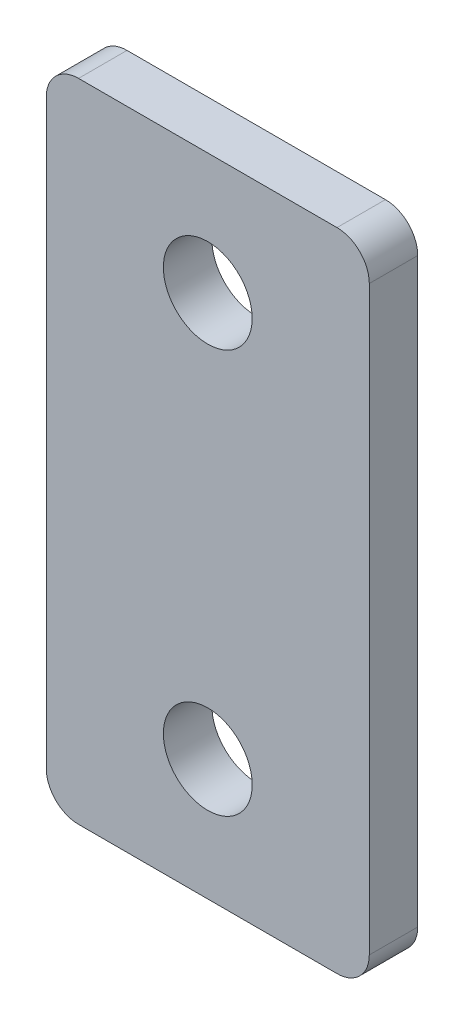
ISO-10303-21;
HEADER;
FILE_DESCRIPTION(('STEP AP214'),'2;1');
FILE_NAME('part.step','',(''),(''),'','','');
FILE_SCHEMA(('AUTOMOTIVE_DESIGN { 1 0 10303 214 1 1 1 1 }'));
ENDSEC;
DATA;
#1=APPLICATION_CONTEXT('core data for automotive mechanical design processes');
#2=APPLICATION_PROTOCOL_DEFINITION('international standard','automotive_design',2000,#1);
#3=PRODUCT_CONTEXT('',#1,'mechanical');
#4=PRODUCT('Part','Part','',(#3));
#5=PRODUCT_RELATED_PRODUCT_CATEGORY('part','',(#4));
#6=PRODUCT_DEFINITION_FORMATION('','',#4);
#7=PRODUCT_DEFINITION_CONTEXT('part definition',#1,'design');
#8=PRODUCT_DEFINITION('design','',#6,#7);
#9=PRODUCT_DEFINITION_SHAPE('','',#8);
#10=(LENGTH_UNIT() NAMED_UNIT(*) SI_UNIT(.MILLI.,.METRE.));
#11=(NAMED_UNIT(*) PLANE_ANGLE_UNIT() SI_UNIT($,.RADIAN.));
#12=(NAMED_UNIT(*) SI_UNIT($,.STERADIAN.) SOLID_ANGLE_UNIT());
#13=UNCERTAINTY_MEASURE_WITH_UNIT(LENGTH_MEASURE(1.E-05),#10,'distance_accuracy_value','');
#14=(GEOMETRIC_REPRESENTATION_CONTEXT(3) GLOBAL_UNCERTAINTY_ASSIGNED_CONTEXT((#13)) GLOBAL_UNIT_ASSIGNED_CONTEXT((#10,
#11,#12)) REPRESENTATION_CONTEXT('',''));
#15=CARTESIAN_POINT('',(0.,0.,0.));
#16=DIRECTION('',(0.,0.,1.));
#17=DIRECTION('',(1.,0.,0.));
#18=AXIS2_PLACEMENT_3D('',#15,#16,#17);
#19=CARTESIAN_POINT('',(2.,38.,0.));
#20=DIRECTION('',(0.,0.,-1.));
#21=DIRECTION('',(-1.,0.,0.));
#22=AXIS2_PLACEMENT_3D('',#19,#20,#21);
#23=PLANE('',#22);
#24=CARTESIAN_POINT('',(10.,32.5,0.));
#25=DIRECTION('',(0.,0.,1.));
#26=DIRECTION('',(1.,0.,0.));
#27=AXIS2_PLACEMENT_3D('',#24,#25,#26);
#28=CIRCLE('',#27,2.75);
#29=CARTESIAN_POINT('',(12.75,32.5,0.));
#30=VERTEX_POINT('',#29);
#31=EDGE_CURVE('E119',#30,#30,#28,.T.);
#32=ORIENTED_EDGE('',*,*,#31,.T.);
#33=EDGE_LOOP('',(#32));
#34=FACE_BOUND('',#33,.T.);
#35=CARTESIAN_POINT('',(2.,38.,0.));
#36=DIRECTION('',(0.,0.,-1.));
#37=DIRECTION('',(-1.,0.,0.));
#38=AXIS2_PLACEMENT_3D('',#35,#36,#37);
#39=CIRCLE('',#38,2.);
#40=CARTESIAN_POINT('',(0.,38.,0.));
#41=VERTEX_POINT('',#40);
#42=CARTESIAN_POINT('',(2.,40.,0.));
#43=VERTEX_POINT('',#42);
#44=EDGE_CURVE('E96',#41,#43,#39,.T.);
#45=ORIENTED_EDGE('',*,*,#44,.T.);
#46=DIRECTION('',(1.,0.,0.));
#47=VECTOR('',#46,1.);
#48=CARTESIAN_POINT('',(2.,40.,0.));
#49=LINE('',#48,#47);
#50=CARTESIAN_POINT('',(18.,40.,0.));
#51=VERTEX_POINT('',#50);
#52=EDGE_CURVE('E103',#43,#51,#49,.T.);
#53=ORIENTED_EDGE('',*,*,#52,.T.);
#54=CARTESIAN_POINT('',(18.,38.,0.));
#55=DIRECTION('',(0.,0.,1.));
#56=DIRECTION('',(1.,0.,0.));
#57=AXIS2_PLACEMENT_3D('',#54,#55,#56);
#58=CIRCLE('',#57,2.);
#59=CARTESIAN_POINT('',(20.,38.,0.));
#60=VERTEX_POINT('',#59);
#61=EDGE_CURVE('E109',#60,#51,#58,.T.);
#62=ORIENTED_EDGE('',*,*,#61,.F.);
#63=DIRECTION('',(0.,1.,0.));
#64=VECTOR('',#63,1.);
#65=CARTESIAN_POINT('',(20.,2.00000000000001,0.));
#66=LINE('',#65,#64);
#67=CARTESIAN_POINT('',(20.,2.00000000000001,0.));
#68=VERTEX_POINT('',#67);
#69=EDGE_CURVE('E124',#68,#60,#66,.T.);
#70=ORIENTED_EDGE('',*,*,#69,.F.);
#71=CARTESIAN_POINT('',(18.,2.,0.));
#72=DIRECTION('',(0.,0.,-1.));
#73=DIRECTION('',(-1.,0.,0.));
#74=AXIS2_PLACEMENT_3D('',#71,#72,#73);
#75=CIRCLE('',#74,2.);
#76=CARTESIAN_POINT('',(18.,0.,0.));
#77=VERTEX_POINT('',#76);
#78=EDGE_CURVE('E126',#68,#77,#75,.T.);
#79=ORIENTED_EDGE('',*,*,#78,.T.);
#80=DIRECTION('',(-1.,0.,0.));
#81=VECTOR('',#80,1.);
#82=CARTESIAN_POINT('',(18.,0.,0.));
#83=LINE('',#82,#81);
#84=CARTESIAN_POINT('',(2.00000000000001,0.,0.));
#85=VERTEX_POINT('',#84);
#86=EDGE_CURVE('E129',#77,#85,#83,.T.);
#87=ORIENTED_EDGE('',*,*,#86,.T.);
#88=CARTESIAN_POINT('',(2.,2.,0.));
#89=DIRECTION('',(0.,0.,-1.));
#90=DIRECTION('',(-1.,0.,0.));
#91=AXIS2_PLACEMENT_3D('',#88,#89,#90);
#92=CIRCLE('',#91,2.);
#93=CARTESIAN_POINT('',(0.,2.00000000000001,0.));
#94=VERTEX_POINT('',#93);
#95=EDGE_CURVE('E132',#85,#94,#92,.T.);
#96=ORIENTED_EDGE('',*,*,#95,.T.);
#97=DIRECTION('',(0.,-1.,0.));
#98=VECTOR('',#97,1.);
#99=CARTESIAN_POINT('',(0.,38.,0.));
#100=LINE('',#99,#98);
#101=EDGE_CURVE('E115',#41,#94,#100,.T.);
#102=ORIENTED_EDGE('',*,*,#101,.F.);
#103=EDGE_LOOP('',(#45,#53,#62,#70,#79,#87,#96,#102));
#104=FACE_BOUND('',#103,.T.);
#105=CARTESIAN_POINT('',(10.,7.5,0.));
#106=DIRECTION('',(0.,0.,1.));
#107=DIRECTION('',(1.,0.,0.));
#108=AXIS2_PLACEMENT_3D('',#105,#106,#107);
#109=CIRCLE('',#108,2.75);
#110=CARTESIAN_POINT('',(12.75,7.5,0.));
#111=VERTEX_POINT('',#110);
#112=EDGE_CURVE('E262',#111,#111,#109,.T.);
#113=ORIENTED_EDGE('',*,*,#112,.T.);
#114=EDGE_LOOP('',(#113));
#115=FACE_BOUND('',#114,.T.);
#116=ADVANCED_FACE('F30',(#34,#104,#115),#23,.T.);
#117=CARTESIAN_POINT('',(2.,38.,3.));
#118=DIRECTION('',(0.,0.,-1.));
#119=DIRECTION('',(-1.,0.,0.));
#120=AXIS2_PLACEMENT_3D('',#117,#118,#119);
#121=PLANE('',#120);
#122=CARTESIAN_POINT('',(10.,32.5,3.));
#123=DIRECTION('',(0.,0.,1.));
#124=DIRECTION('',(1.,0.,0.));
#125=AXIS2_PLACEMENT_3D('',#122,#123,#124);
#126=CIRCLE('',#125,2.75);
#127=CARTESIAN_POINT('',(12.75,32.5,3.));
#128=VERTEX_POINT('',#127);
#129=EDGE_CURVE('E116',#128,#128,#126,.T.);
#130=ORIENTED_EDGE('',*,*,#129,.F.);
#131=EDGE_LOOP('',(#130));
#132=FACE_BOUND('',#131,.T.);
#133=CARTESIAN_POINT('',(2.,38.,3.));
#134=DIRECTION('',(0.,0.,-1.));
#135=DIRECTION('',(-1.,0.,0.));
#136=AXIS2_PLACEMENT_3D('',#133,#134,#135);
#137=CIRCLE('',#136,2.);
#138=CARTESIAN_POINT('',(0.,38.,3.));
#139=VERTEX_POINT('',#138);
#140=CARTESIAN_POINT('',(2.,40.,3.));
#141=VERTEX_POINT('',#140);
#142=EDGE_CURVE('E97',#139,#141,#137,.T.);
#143=ORIENTED_EDGE('',*,*,#142,.F.);
#144=DIRECTION('',(0.,-1.,0.));
#145=VECTOR('',#144,1.);
#146=CARTESIAN_POINT('',(0.,38.,3.));
#147=LINE('',#146,#145);
#148=CARTESIAN_POINT('',(0.,2.00000000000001,3.));
#149=VERTEX_POINT('',#148);
#150=EDGE_CURVE('E52',#139,#149,#147,.T.);
#151=ORIENTED_EDGE('',*,*,#150,.T.);
#152=CARTESIAN_POINT('',(2.,2.,3.));
#153=DIRECTION('',(0.,0.,-1.));
#154=DIRECTION('',(-1.,0.,0.));
#155=AXIS2_PLACEMENT_3D('',#152,#153,#154);
#156=CIRCLE('',#155,2.);
#157=CARTESIAN_POINT('',(2.00000000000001,0.,3.));
#158=VERTEX_POINT('',#157);
#159=EDGE_CURVE('E148',#158,#149,#156,.T.);
#160=ORIENTED_EDGE('',*,*,#159,.F.);
#161=DIRECTION('',(-1.,0.,0.));
#162=VECTOR('',#161,1.);
#163=CARTESIAN_POINT('',(18.,0.,3.));
#164=LINE('',#163,#162);
#165=CARTESIAN_POINT('',(18.,0.,3.));
#166=VERTEX_POINT('',#165);
#167=EDGE_CURVE('E145',#166,#158,#164,.T.);
#168=ORIENTED_EDGE('',*,*,#167,.F.);
#169=CARTESIAN_POINT('',(18.,2.,3.));
#170=DIRECTION('',(0.,0.,-1.));
#171=DIRECTION('',(-1.,0.,0.));
#172=AXIS2_PLACEMENT_3D('',#169,#170,#171);
#173=CIRCLE('',#172,2.);
#174=CARTESIAN_POINT('',(20.,2.00000000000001,3.));
#175=VERTEX_POINT('',#174);
#176=EDGE_CURVE('E142',#175,#166,#173,.T.);
#177=ORIENTED_EDGE('',*,*,#176,.F.);
#178=DIRECTION('',(0.,1.,0.));
#179=VECTOR('',#178,1.);
#180=CARTESIAN_POINT('',(20.,2.00000000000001,3.));
#181=LINE('',#180,#179);
#182=CARTESIAN_POINT('',(20.,38.,3.));
#183=VERTEX_POINT('',#182);
#184=EDGE_CURVE('E140',#175,#183,#181,.T.);
#185=ORIENTED_EDGE('',*,*,#184,.T.);
#186=CARTESIAN_POINT('',(18.,38.,3.));
#187=DIRECTION('',(0.,0.,1.));
#188=DIRECTION('',(1.,0.,0.));
#189=AXIS2_PLACEMENT_3D('',#186,#187,#188);
#190=CIRCLE('',#189,2.);
#191=CARTESIAN_POINT('',(18.,40.,3.));
#192=VERTEX_POINT('',#191);
#193=EDGE_CURVE('E138',#183,#192,#190,.T.);
#194=ORIENTED_EDGE('',*,*,#193,.T.);
#195=DIRECTION('',(1.,0.,0.));
#196=VECTOR('',#195,1.);
#197=CARTESIAN_POINT('',(2.,40.,3.));
#198=LINE('',#197,#196);
#199=EDGE_CURVE('E136',#141,#192,#198,.T.);
#200=ORIENTED_EDGE('',*,*,#199,.F.);
#201=EDGE_LOOP('',(#143,#151,#160,#168,#177,#185,#194,#200));
#202=FACE_BOUND('',#201,.T.);
#203=CARTESIAN_POINT('',(10.,7.5,3.));
#204=DIRECTION('',(0.,0.,1.));
#205=DIRECTION('',(1.,0.,0.));
#206=AXIS2_PLACEMENT_3D('',#203,#204,#205);
#207=CIRCLE('',#206,2.75);
#208=CARTESIAN_POINT('',(12.75,7.5,3.));
#209=VERTEX_POINT('',#208);
#210=EDGE_CURVE('E259',#209,#209,#207,.T.);
#211=ORIENTED_EDGE('',*,*,#210,.F.);
#212=EDGE_LOOP('',(#211));
#213=FACE_BOUND('',#212,.T.);
#214=ADVANCED_FACE('F181',(#132,#202,#213),#121,.F.);
#215=CARTESIAN_POINT('',(2.,38.,3.));
#216=DIRECTION('',(0.,0.,-1.));
#217=DIRECTION('',(-1.,0.,0.));
#218=AXIS2_PLACEMENT_3D('',#215,#216,#217);
#219=CYLINDRICAL_SURFACE('',#218,2.);
#220=ORIENTED_EDGE('',*,*,#44,.F.);
#221=DIRECTION('',(0.,0.,-1.));
#222=VECTOR('',#221,1.);
#223=CARTESIAN_POINT('',(0.,38.,3.));
#224=LINE('',#223,#222);
#225=EDGE_CURVE('E11',#139,#41,#224,.T.);
#226=ORIENTED_EDGE('',*,*,#225,.F.);
#227=ORIENTED_EDGE('',*,*,#142,.T.);
#228=DIRECTION('',(0.,0.,-1.));
#229=VECTOR('',#228,1.);
#230=CARTESIAN_POINT('',(2.,40.,3.));
#231=LINE('',#230,#229);
#232=EDGE_CURVE('E34',#141,#43,#231,.T.);
#233=ORIENTED_EDGE('',*,*,#232,.T.);
#234=EDGE_LOOP('',(#220,#226,#227,#233));
#235=FACE_BOUND('',#234,.T.);
#236=ADVANCED_FACE('F32',(#235),#219,.T.);
#237=CARTESIAN_POINT('',(0.,38.,3.));
#238=DIRECTION('',(1.,0.,0.));
#239=DIRECTION('',(0.,1.,0.));
#240=AXIS2_PLACEMENT_3D('',#237,#238,#239);
#241=PLANE('',#240);
#242=ORIENTED_EDGE('',*,*,#101,.T.);
#243=DIRECTION('',(0.,0.,-1.));
#244=VECTOR('',#243,1.);
#245=CARTESIAN_POINT('',(0.,2.00000000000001,3.));
#246=LINE('',#245,#244);
#247=EDGE_CURVE('E39',#149,#94,#246,.T.);
#248=ORIENTED_EDGE('',*,*,#247,.F.);
#249=ORIENTED_EDGE('',*,*,#150,.F.);
#250=ORIENTED_EDGE('',*,*,#225,.T.);
#251=EDGE_LOOP('',(#242,#248,#249,#250));
#252=FACE_BOUND('',#251,.T.);
#253=ADVANCED_FACE('F180',(#252),#241,.F.);
#254=CARTESIAN_POINT('',(2.,2.,3.));
#255=DIRECTION('',(0.,0.,-1.));
#256=DIRECTION('',(-1.,0.,0.));
#257=AXIS2_PLACEMENT_3D('',#254,#255,#256);
#258=CYLINDRICAL_SURFACE('',#257,2.);
#259=ORIENTED_EDGE('',*,*,#95,.F.);
#260=DIRECTION('',(0.,0.,-1.));
#261=VECTOR('',#260,1.);
#262=CARTESIAN_POINT('',(2.00000000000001,0.,3.));
#263=LINE('',#262,#261);
#264=EDGE_CURVE('E153',#158,#85,#263,.T.);
#265=ORIENTED_EDGE('',*,*,#264,.F.);
#266=ORIENTED_EDGE('',*,*,#159,.T.);
#267=ORIENTED_EDGE('',*,*,#247,.T.);
#268=EDGE_LOOP('',(#259,#265,#266,#267));
#269=FACE_BOUND('',#268,.T.);
#270=ADVANCED_FACE('F178',(#269),#258,.T.);
#271=CARTESIAN_POINT('',(18.,0.,3.));
#272=DIRECTION('',(0.,-1.,0.));
#273=DIRECTION('',(1.,0.,0.));
#274=AXIS2_PLACEMENT_3D('',#271,#272,#273);
#275=PLANE('',#274);
#276=ORIENTED_EDGE('',*,*,#86,.F.);
#277=DIRECTION('',(0.,0.,-1.));
#278=VECTOR('',#277,1.);
#279=CARTESIAN_POINT('',(18.,0.,3.));
#280=LINE('',#279,#278);
#281=EDGE_CURVE('E155',#166,#77,#280,.T.);
#282=ORIENTED_EDGE('',*,*,#281,.F.);
#283=ORIENTED_EDGE('',*,*,#167,.T.);
#284=ORIENTED_EDGE('',*,*,#264,.T.);
#285=EDGE_LOOP('',(#276,#282,#283,#284));
#286=FACE_BOUND('',#285,.T.);
#287=ADVANCED_FACE('F175',(#286),#275,.T.);
#288=CARTESIAN_POINT('',(18.,2.,3.));
#289=DIRECTION('',(0.,0.,-1.));
#290=DIRECTION('',(-1.,0.,0.));
#291=AXIS2_PLACEMENT_3D('',#288,#289,#290);
#292=CYLINDRICAL_SURFACE('',#291,2.);
#293=ORIENTED_EDGE('',*,*,#78,.F.);
#294=DIRECTION('',(0.,0.,-1.));
#295=VECTOR('',#294,1.);
#296=CARTESIAN_POINT('',(20.,2.00000000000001,3.));
#297=LINE('',#296,#295);
#298=EDGE_CURVE('E157',#175,#68,#297,.T.);
#299=ORIENTED_EDGE('',*,*,#298,.F.);
#300=ORIENTED_EDGE('',*,*,#176,.T.);
#301=ORIENTED_EDGE('',*,*,#281,.T.);
#302=EDGE_LOOP('',(#293,#299,#300,#301));
#303=FACE_BOUND('',#302,.T.);
#304=ADVANCED_FACE('F170',(#303),#292,.T.);
#305=CARTESIAN_POINT('',(20.,2.00000000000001,3.));
#306=DIRECTION('',(-1.,0.,0.));
#307=DIRECTION('',(0.,-1.,0.));
#308=AXIS2_PLACEMENT_3D('',#305,#306,#307);
#309=PLANE('',#308);
#310=ORIENTED_EDGE('',*,*,#69,.T.);
#311=DIRECTION('',(0.,0.,-1.));
#312=VECTOR('',#311,1.);
#313=CARTESIAN_POINT('',(20.,38.,3.));
#314=LINE('',#313,#312);
#315=EDGE_CURVE('E159',#183,#60,#314,.T.);
#316=ORIENTED_EDGE('',*,*,#315,.F.);
#317=ORIENTED_EDGE('',*,*,#184,.F.);
#318=ORIENTED_EDGE('',*,*,#298,.T.);
#319=EDGE_LOOP('',(#310,#316,#317,#318));
#320=FACE_BOUND('',#319,.T.);
#321=ADVANCED_FACE('F183',(#320),#309,.F.);
#322=CARTESIAN_POINT('',(18.,38.,3.));
#323=DIRECTION('',(0.,0.,-1.));
#324=DIRECTION('',(-1.,0.,0.));
#325=AXIS2_PLACEMENT_3D('',#322,#323,#324);
#326=CYLINDRICAL_SURFACE('',#325,2.);
#327=ORIENTED_EDGE('',*,*,#61,.T.);
#328=DIRECTION('',(0.,0.,-1.));
#329=VECTOR('',#328,1.);
#330=CARTESIAN_POINT('',(18.,40.,3.));
#331=LINE('',#330,#329);
#332=EDGE_CURVE('E101',#192,#51,#331,.T.);
#333=ORIENTED_EDGE('',*,*,#332,.F.);
#334=ORIENTED_EDGE('',*,*,#193,.F.);
#335=ORIENTED_EDGE('',*,*,#315,.T.);
#336=EDGE_LOOP('',(#327,#333,#334,#335));
#337=FACE_BOUND('',#336,.T.);
#338=ADVANCED_FACE('F164',(#337),#326,.T.);
#339=CARTESIAN_POINT('',(2.,40.,3.));
#340=DIRECTION('',(0.,1.,0.));
#341=DIRECTION('',(0.,0.,1.));
#342=AXIS2_PLACEMENT_3D('',#339,#340,#341);
#343=PLANE('',#342);
#344=ORIENTED_EDGE('',*,*,#52,.F.);
#345=ORIENTED_EDGE('',*,*,#232,.F.);
#346=ORIENTED_EDGE('',*,*,#199,.T.);
#347=ORIENTED_EDGE('',*,*,#332,.T.);
#348=EDGE_LOOP('',(#344,#345,#346,#347));
#349=FACE_BOUND('',#348,.T.);
#350=ADVANCED_FACE('F104',(#349),#343,.T.);
#351=CARTESIAN_POINT('',(10.,32.5,3.));
#352=DIRECTION('',(0.,0.,-1.));
#353=DIRECTION('',(-1.,0.,0.));
#354=AXIS2_PLACEMENT_3D('',#351,#352,#353);
#355=CYLINDRICAL_SURFACE('',#354,2.75);
#356=ORIENTED_EDGE('',*,*,#129,.T.);
#357=EDGE_LOOP('',(#356));
#358=FACE_BOUND('',#357,.T.);
#359=ORIENTED_EDGE('',*,*,#31,.F.);
#360=EDGE_LOOP('',(#359));
#361=FACE_BOUND('',#360,.T.);
#362=ADVANCED_FACE('F202',(#358,#361),#355,.F.);
#363=CARTESIAN_POINT('',(10.,7.5,3.));
#364=DIRECTION('',(0.,0.,-1.));
#365=DIRECTION('',(-1.,0.,0.));
#366=AXIS2_PLACEMENT_3D('',#363,#364,#365);
#367=CYLINDRICAL_SURFACE('',#366,2.75);
#368=ORIENTED_EDGE('',*,*,#210,.T.);
#369=EDGE_LOOP('',(#368));
#370=FACE_BOUND('',#369,.T.);
#371=ORIENTED_EDGE('',*,*,#112,.F.);
#372=EDGE_LOOP('',(#371));
#373=FACE_BOUND('',#372,.T.);
#374=ADVANCED_FACE('F244',(#370,#373),#367,.F.);
#375=CLOSED_SHELL('',(#116,#214,#236,#253,#270,#287,#304,#321,#338,#350,#362,#374));
#376=MANIFOLD_SOLID_BREP('B2',#375);
#377=ADVANCED_BREP_SHAPE_REPRESENTATION('',(#18,#376),#14);
#378=SHAPE_DEFINITION_REPRESENTATION(#9,#377);
ENDSEC;
END-ISO-10303-21;
